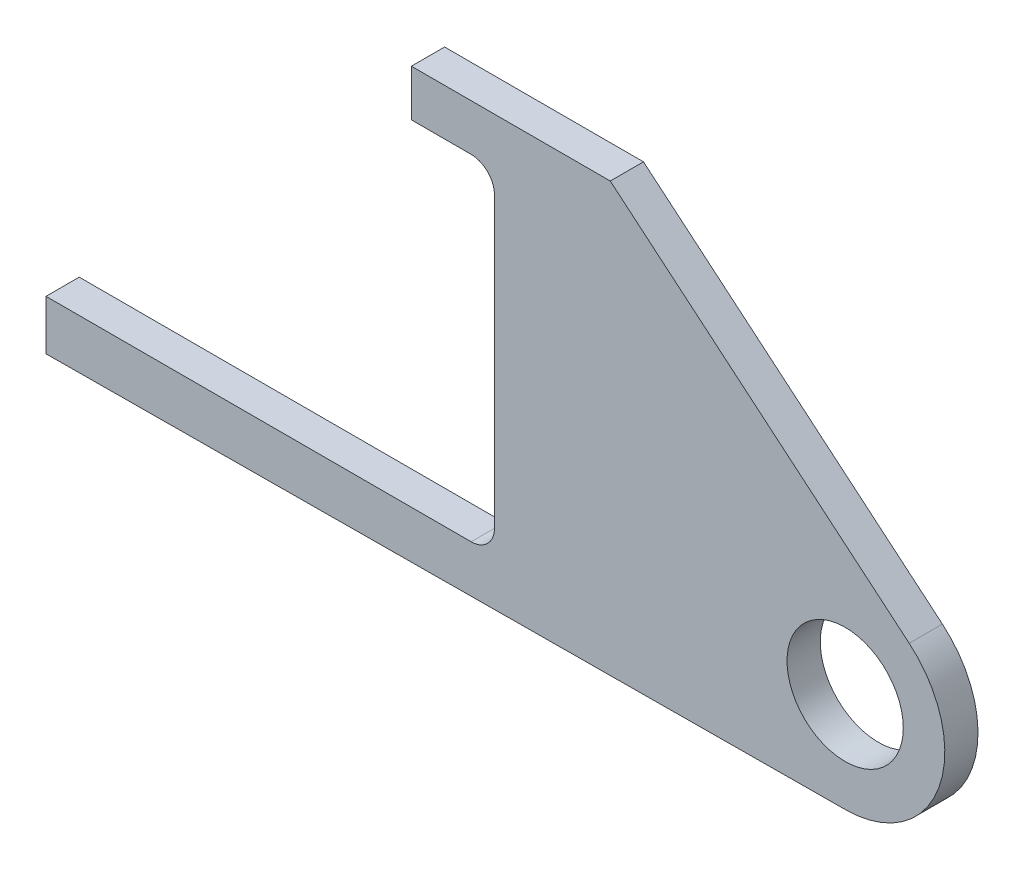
from build123d import *

# Parameters (mm, degrees)
ESQUISSE1_R      = 35
EXTRUSION1_DEPTH = 20


with BuildPart() as part:
    # Esquisse1 → Extrusion1 (new body)
    with BuildSketch(Plane.XY):
        with BuildLine():
            Line((-481.18, -33), (-225.18, -33))
            ThreePointArc((-225.18, -33), (-215.280505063, -28.899494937), (-211.18, -19))
            Line((-211.18, -19), (-211.18, 155))
            ThreePointArc((-211.18, 155), (-215.280505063, 164.899494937), (-225.18, 169))
            Line((-225.18, 169), (-261.18, 169))
            Line((-261.18, 169), (-261.18, 197))
            Line((-261.18, 197), (-141.432028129, 197))
            Line((-141.432028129, 197), (38.567256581, 45.962666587))
            ThreePointArc((38.567256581, 45.962666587), (56.445229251, -20.345419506), (0.373927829, -59.998834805))
            Line((0.373927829, -59.998834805), (-481.18, -63))
            Line((-481.18, -63), (-481.18, -33))
        make_face()
        Circle(ESQUISSE1_R, mode=Mode.SUBTRACT)
    extrude(amount=EXTRUSION1_DEPTH)


solid = part.part
